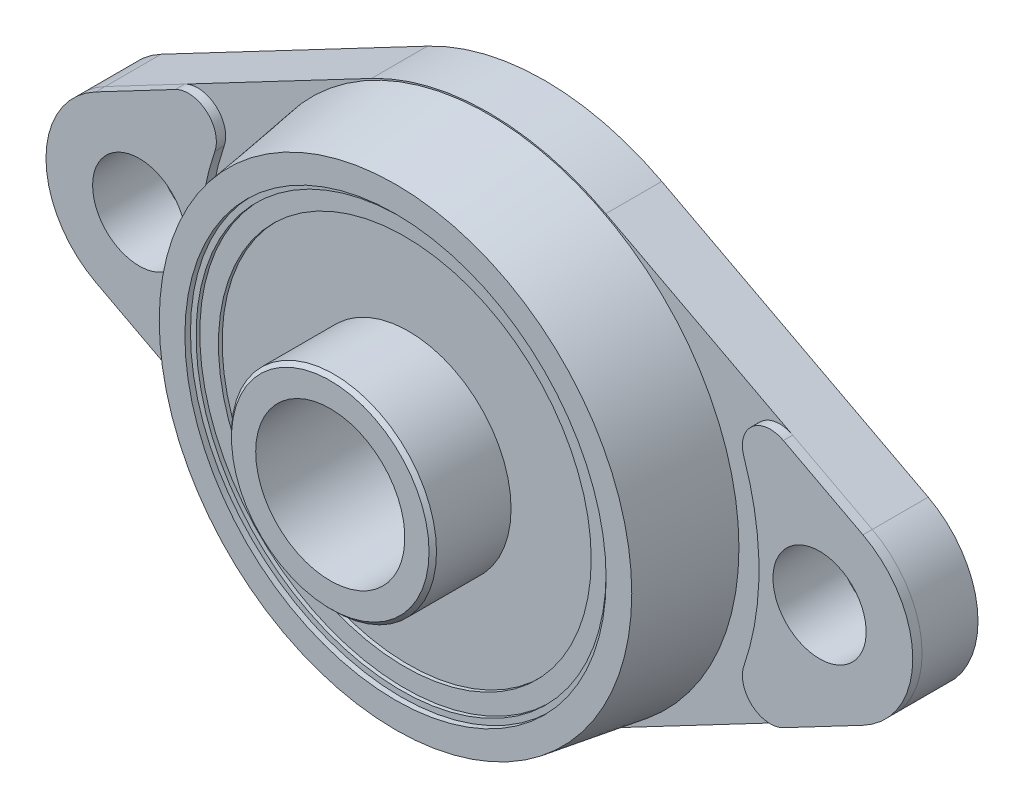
ISO-10303-21;
HEADER;
FILE_DESCRIPTION(('STEP AP214'),'2;1');
FILE_NAME('part.step','',(''),(''),'','','');
FILE_SCHEMA(('AUTOMOTIVE_DESIGN { 1 0 10303 214 1 1 1 1 }'));
ENDSEC;
DATA;
#1=APPLICATION_CONTEXT('core data for automotive mechanical design processes');
#2=APPLICATION_PROTOCOL_DEFINITION('international standard','automotive_design',2000,#1);
#3=PRODUCT_CONTEXT('',#1,'mechanical');
#4=PRODUCT('Part','Part','',(#3));
#5=PRODUCT_RELATED_PRODUCT_CATEGORY('part','',(#4));
#6=PRODUCT_DEFINITION_FORMATION('','',#4);
#7=PRODUCT_DEFINITION_CONTEXT('part definition',#1,'design');
#8=PRODUCT_DEFINITION('design','',#6,#7);
#9=PRODUCT_DEFINITION_SHAPE('','',#8);
#10=(LENGTH_UNIT() NAMED_UNIT(*) SI_UNIT(.MILLI.,.METRE.));
#11=(NAMED_UNIT(*) PLANE_ANGLE_UNIT() SI_UNIT($,.RADIAN.));
#12=(NAMED_UNIT(*) SI_UNIT($,.STERADIAN.) SOLID_ANGLE_UNIT());
#13=UNCERTAINTY_MEASURE_WITH_UNIT(LENGTH_MEASURE(1.E-05),#10,'distance_accuracy_value','');
#14=(GEOMETRIC_REPRESENTATION_CONTEXT(3) GLOBAL_UNCERTAINTY_ASSIGNED_CONTEXT((#13)) GLOBAL_UNIT_ASSIGNED_CONTEXT((#10,
#11,#12)) REPRESENTATION_CONTEXT('',''));
#15=CARTESIAN_POINT('',(0.,0.,0.));
#16=DIRECTION('',(0.,0.,1.));
#17=DIRECTION('',(1.,0.,0.));
#18=AXIS2_PLACEMENT_3D('',#15,#16,#17);
#19=CARTESIAN_POINT('',(-15.61047857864,5.344432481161,3.));
#20=DIRECTION('',(0.,0.,-1.));
#21=DIRECTION('',(1.,0.,0.));
#22=AXIS2_PLACEMENT_3D('',#19,#20,#21);
#23=CYLINDRICAL_SURFACE('',#22,1.5);
#24=CARTESIAN_POINT('',(-15.61047857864,5.344432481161,3.));
#25=DIRECTION('',(0.,0.,1.));
#26=DIRECTION('',(1.,0.,0.));
#27=AXIS2_PLACEMENT_3D('',#24,#25,#26);
#28=CIRCLE('',#27,1.5);
#29=CARTESIAN_POINT('',(-14.1913441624,4.858574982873,3.));
#30=VERTEX_POINT('',#29);
#31=CARTESIAN_POINT('',(-16.30910868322,6.671804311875,3.));
#32=VERTEX_POINT('',#31);
#33=EDGE_CURVE('E386',#30,#32,#28,.T.);
#34=ORIENTED_EDGE('',*,*,#33,.T.);
#35=DIRECTION('',(0.,0.,1.));
#36=VECTOR('',#35,1.);
#37=CARTESIAN_POINT('',(-16.30910868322,6.671804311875,3.));
#38=LINE('',#37,#36);
#39=CARTESIAN_POINT('',(-16.30910868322,6.671804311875,3.5));
#40=VERTEX_POINT('',#39);
#41=EDGE_CURVE('E353',#32,#40,#38,.T.);
#42=ORIENTED_EDGE('',*,*,#41,.T.);
#43=CARTESIAN_POINT('',(-15.61047857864,5.344432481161,3.5));
#44=DIRECTION('',(0.,0.,1.));
#45=DIRECTION('',(1.,0.,0.));
#46=AXIS2_PLACEMENT_3D('',#43,#44,#45);
#47=CIRCLE('',#46,1.5);
#48=CARTESIAN_POINT('',(-14.1913441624,4.858574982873,3.5));
#49=VERTEX_POINT('',#48);
#50=EDGE_CURVE('E397',#49,#40,#47,.T.);
#51=ORIENTED_EDGE('',*,*,#50,.F.);
#52=DIRECTION('',(0.,0.,1.));
#53=VECTOR('',#52,1.);
#54=CARTESIAN_POINT('',(-14.1913441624,4.858574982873,3.));
#55=LINE('',#54,#53);
#56=EDGE_CURVE('E9',#30,#49,#55,.T.);
#57=ORIENTED_EDGE('',*,*,#56,.F.);
#58=EDGE_LOOP('',(#34,#42,#51,#57));
#59=FACE_BOUND('',#58,.T.);
#60=ADVANCED_FACE('F15',(#59),#23,.T.);
#61=CARTESIAN_POINT('',(0.,0.,3.));
#62=DIRECTION('',(0.,0.,-1.));
#63=DIRECTION('',(1.,0.,0.));
#64=AXIS2_PLACEMENT_3D('',#61,#62,#63);
#65=CYLINDRICAL_SURFACE('',#64,15.);
#66=ORIENTED_EDGE('',*,*,#56,.T.);
#67=CARTESIAN_POINT('',(0.,0.,3.5));
#68=DIRECTION('',(0.,0.,1.));
#69=DIRECTION('',(1.,0.,0.));
#70=AXIS2_PLACEMENT_3D('',#67,#68,#69);
#71=CIRCLE('',#70,15.);
#72=CARTESIAN_POINT('',(-14.1913441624,-4.858574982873,3.5));
#73=VERTEX_POINT('',#72);
#74=EDGE_CURVE('E535',#49,#73,#71,.T.);
#75=ORIENTED_EDGE('',*,*,#74,.T.);
#76=DIRECTION('',(0.,0.,1.));
#77=VECTOR('',#76,1.);
#78=CARTESIAN_POINT('',(-14.1913441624,-4.858574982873,3.));
#79=LINE('',#78,#77);
#80=CARTESIAN_POINT('',(-14.1913441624,-4.858574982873,3.));
#81=VERTEX_POINT('',#80);
#82=EDGE_CURVE('E26',#81,#73,#79,.T.);
#83=ORIENTED_EDGE('',*,*,#82,.F.);
#84=CARTESIAN_POINT('',(0.,0.,3.));
#85=DIRECTION('',(0.,0.,1.));
#86=DIRECTION('',(1.,0.,0.));
#87=AXIS2_PLACEMENT_3D('',#84,#85,#86);
#88=CIRCLE('',#87,15.);
#89=EDGE_CURVE('E489',#30,#81,#88,.T.);
#90=ORIENTED_EDGE('',*,*,#89,.F.);
#91=EDGE_LOOP('',(#66,#75,#83,#90));
#92=FACE_BOUND('',#91,.T.);
#93=ADVANCED_FACE('F701',(#92),#65,.F.);
#94=CARTESIAN_POINT('',(-15.61047857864,-5.344432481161,3.));
#95=DIRECTION('',(0.,0.,-1.));
#96=DIRECTION('',(1.,0.,0.));
#97=AXIS2_PLACEMENT_3D('',#94,#95,#96);
#98=CYLINDRICAL_SURFACE('',#97,1.5);
#99=CARTESIAN_POINT('',(-15.61047857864,-5.344432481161,3.));
#100=DIRECTION('',(0.,0.,1.));
#101=DIRECTION('',(1.,0.,0.));
#102=AXIS2_PLACEMENT_3D('',#99,#100,#101);
#103=CIRCLE('',#102,1.5);
#104=CARTESIAN_POINT('',(-16.30910868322,-6.671804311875,3.));
#105=VERTEX_POINT('',#104);
#106=EDGE_CURVE('E493',#105,#81,#103,.T.);
#107=ORIENTED_EDGE('',*,*,#106,.T.);
#108=ORIENTED_EDGE('',*,*,#82,.T.);
#109=CARTESIAN_POINT('',(-15.61047857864,-5.344432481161,3.5));
#110=DIRECTION('',(0.,0.,1.));
#111=DIRECTION('',(1.,0.,0.));
#112=AXIS2_PLACEMENT_3D('',#109,#110,#111);
#113=CIRCLE('',#112,1.5);
#114=CARTESIAN_POINT('',(-16.30910868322,-6.671804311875,3.5));
#115=VERTEX_POINT('',#114);
#116=EDGE_CURVE('E199',#115,#73,#113,.T.);
#117=ORIENTED_EDGE('',*,*,#116,.F.);
#118=DIRECTION('',(0.,0.,1.));
#119=VECTOR('',#118,1.);
#120=CARTESIAN_POINT('',(-16.30910868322,-6.671804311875,3.));
#121=LINE('',#120,#119);
#122=EDGE_CURVE('E349',#105,#115,#121,.T.);
#123=ORIENTED_EDGE('',*,*,#122,.F.);
#124=EDGE_LOOP('',(#107,#108,#117,#123));
#125=FACE_BOUND('',#124,.T.);
#126=ADVANCED_FACE('F707',(#125),#98,.T.);
#127=CARTESIAN_POINT('',(15.610478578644,5.344432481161,3.));
#128=DIRECTION('',(0.,0.,-1.));
#129=DIRECTION('',(1.,0.,0.));
#130=AXIS2_PLACEMENT_3D('',#127,#128,#129);
#131=CYLINDRICAL_SURFACE('',#130,1.5);
#132=CARTESIAN_POINT('',(15.610478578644,5.344432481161,3.));
#133=DIRECTION('',(0.,0.,1.));
#134=DIRECTION('',(1.,0.,0.));
#135=AXIS2_PLACEMENT_3D('',#132,#133,#134);
#136=CIRCLE('',#135,1.5);
#137=CARTESIAN_POINT('',(16.309108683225,6.671804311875,3.));
#138=VERTEX_POINT('',#137);
#139=CARTESIAN_POINT('',(14.191344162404,4.858574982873,3.));
#140=VERTEX_POINT('',#139);
#141=EDGE_CURVE('E383',#138,#140,#136,.T.);
#142=ORIENTED_EDGE('',*,*,#141,.T.);
#143=DIRECTION('',(0.,0.,1.));
#144=VECTOR('',#143,1.);
#145=CARTESIAN_POINT('',(14.191344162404,4.858574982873,3.));
#146=LINE('',#145,#144);
#147=CARTESIAN_POINT('',(14.191344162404,4.858574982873,3.5));
#148=VERTEX_POINT('',#147);
#149=EDGE_CURVE('E40',#140,#148,#146,.T.);
#150=ORIENTED_EDGE('',*,*,#149,.T.);
#151=CARTESIAN_POINT('',(15.610478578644,5.344432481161,3.5));
#152=DIRECTION('',(0.,0.,1.));
#153=DIRECTION('',(1.,0.,0.));
#154=AXIS2_PLACEMENT_3D('',#151,#152,#153);
#155=CIRCLE('',#154,1.5);
#156=CARTESIAN_POINT('',(16.309108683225,6.671804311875,3.5));
#157=VERTEX_POINT('',#156);
#158=EDGE_CURVE('E340',#157,#148,#155,.T.);
#159=ORIENTED_EDGE('',*,*,#158,.F.);
#160=DIRECTION('',(0.,0.,1.));
#161=VECTOR('',#160,1.);
#162=CARTESIAN_POINT('',(16.309108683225,6.671804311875,3.));
#163=LINE('',#162,#161);
#164=EDGE_CURVE('E388',#138,#157,#163,.T.);
#165=ORIENTED_EDGE('',*,*,#164,.F.);
#166=EDGE_LOOP('',(#142,#150,#159,#165));
#167=FACE_BOUND('',#166,.T.);
#168=ADVANCED_FACE('F667',(#167),#131,.T.);
#169=CARTESIAN_POINT('',(0.,0.,3.));
#170=DIRECTION('',(0.,0.,-1.));
#171=DIRECTION('',(1.,0.,0.));
#172=AXIS2_PLACEMENT_3D('',#169,#170,#171);
#173=CYLINDRICAL_SURFACE('',#172,15.);
#174=DIRECTION('',(0.,0.,1.));
#175=VECTOR('',#174,1.);
#176=CARTESIAN_POINT('',(14.191344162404,-4.858574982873,3.));
#177=LINE('',#176,#175);
#178=CARTESIAN_POINT('',(14.191344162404,-4.858574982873,3.));
#179=VERTEX_POINT('',#178);
#180=CARTESIAN_POINT('',(14.191344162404,-4.858574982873,3.5));
#181=VERTEX_POINT('',#180);
#182=EDGE_CURVE('E342',#179,#181,#177,.T.);
#183=ORIENTED_EDGE('',*,*,#182,.T.);
#184=CARTESIAN_POINT('',(0.,0.,3.5));
#185=DIRECTION('',(0.,0.,1.));
#186=DIRECTION('',(1.,0.,0.));
#187=AXIS2_PLACEMENT_3D('',#184,#185,#186);
#188=CIRCLE('',#187,15.);
#189=EDGE_CURVE('E393',#181,#148,#188,.T.);
#190=ORIENTED_EDGE('',*,*,#189,.T.);
#191=ORIENTED_EDGE('',*,*,#149,.F.);
#192=CARTESIAN_POINT('',(0.,0.,3.));
#193=DIRECTION('',(0.,0.,1.));
#194=DIRECTION('',(1.,0.,0.));
#195=AXIS2_PLACEMENT_3D('',#192,#193,#194);
#196=CIRCLE('',#195,15.);
#197=EDGE_CURVE('E387',#179,#140,#196,.T.);
#198=ORIENTED_EDGE('',*,*,#197,.F.);
#199=EDGE_LOOP('',(#183,#190,#191,#198));
#200=FACE_BOUND('',#199,.T.);
#201=ADVANCED_FACE('F669',(#200),#173,.F.);
#202=CARTESIAN_POINT('',(15.610478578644,-5.344432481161,3.));
#203=DIRECTION('',(0.,0.,-1.));
#204=DIRECTION('',(1.,0.,0.));
#205=AXIS2_PLACEMENT_3D('',#202,#203,#204);
#206=CYLINDRICAL_SURFACE('',#205,1.5);
#207=CARTESIAN_POINT('',(15.610478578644,-5.344432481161,3.));
#208=DIRECTION('',(0.,0.,1.));
#209=DIRECTION('',(1.,0.,0.));
#210=AXIS2_PLACEMENT_3D('',#207,#208,#209);
#211=CIRCLE('',#210,1.5);
#212=CARTESIAN_POINT('',(16.309108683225,-6.671804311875,3.));
#213=VERTEX_POINT('',#212);
#214=EDGE_CURVE('E234',#179,#213,#211,.T.);
#215=ORIENTED_EDGE('',*,*,#214,.T.);
#216=DIRECTION('',(0.,0.,1.));
#217=VECTOR('',#216,1.);
#218=CARTESIAN_POINT('',(16.309108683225,-6.671804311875,3.));
#219=LINE('',#218,#217);
#220=CARTESIAN_POINT('',(16.309108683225,-6.671804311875,3.5));
#221=VERTEX_POINT('',#220);
#222=EDGE_CURVE('E376',#213,#221,#219,.T.);
#223=ORIENTED_EDGE('',*,*,#222,.T.);
#224=CARTESIAN_POINT('',(15.610478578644,-5.344432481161,3.5));
#225=DIRECTION('',(0.,0.,1.));
#226=DIRECTION('',(1.,0.,0.));
#227=AXIS2_PLACEMENT_3D('',#224,#225,#226);
#228=CIRCLE('',#227,1.5);
#229=EDGE_CURVE('E343',#181,#221,#228,.T.);
#230=ORIENTED_EDGE('',*,*,#229,.F.);
#231=ORIENTED_EDGE('',*,*,#182,.F.);
#232=EDGE_LOOP('',(#215,#223,#230,#231));
#233=FACE_BOUND('',#232,.T.);
#234=ADVANCED_FACE('F639',(#233),#206,.T.);
#235=CARTESIAN_POINT('',(0.,1.331029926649E-09,3.5));
#236=DIRECTION('',(0.,0.,1.));
#237=DIRECTION('',(1.,0.,0.));
#238=AXIS2_PLACEMENT_3D('',#235,#236,#237);
#239=PLANE('',#238);
#240=CARTESIAN_POINT('',(18.25,0.,3.5));
#241=DIRECTION('',(0.,0.,1.));
#242=DIRECTION('',(-1.,0.,0.));
#243=AXIS2_PLACEMENT_3D('',#240,#241,#242);
#244=CIRCLE('',#243,2.5);
#245=CARTESIAN_POINT('',(15.75,0.,3.5));
#246=VERTEX_POINT('',#245);
#247=EDGE_CURVE('E77',#246,#246,#244,.T.);
#248=ORIENTED_EDGE('',*,*,#247,.F.);
#249=EDGE_LOOP('',(#248));
#250=FACE_BOUND('',#249,.T.);
#251=ORIENTED_EDGE('',*,*,#189,.F.);
#252=ORIENTED_EDGE('',*,*,#229,.T.);
#253=DIRECTION('',(-0.884914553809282,-0.465753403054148,0.));
#254=VECTOR('',#253,1.);
#255=CARTESIAN_POINT('',(20.578766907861,-4.424572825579,3.5));
#256=LINE('',#255,#254);
#257=CARTESIAN_POINT('',(20.578766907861,-4.424572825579,3.5));
#258=VERTEX_POINT('',#257);
#259=EDGE_CURVE('E372',#258,#221,#256,.T.);
#260=ORIENTED_EDGE('',*,*,#259,.F.);
#261=CARTESIAN_POINT('',(18.25,0.,3.5));
#262=DIRECTION('',(0.,0.,-1.));
#263=DIRECTION('',(-1.,0.,0.));
#264=AXIS2_PLACEMENT_3D('',#261,#262,#263);
#265=CIRCLE('',#264,5.);
#266=CARTESIAN_POINT('',(20.578767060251,4.424572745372,3.5));
#267=VERTEX_POINT('',#266);
#268=EDGE_CURVE('E392',#267,#258,#265,.T.);
#269=ORIENTED_EDGE('',*,*,#268,.F.);
#270=DIRECTION('',(-0.884914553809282,0.465753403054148,0.));
#271=VECTOR('',#270,1.);
#272=CARTESIAN_POINT('',(20.578767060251,4.424572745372,3.5));
#273=LINE('',#272,#271);
#274=EDGE_CURVE('E382',#267,#157,#273,.T.);
#275=ORIENTED_EDGE('',*,*,#274,.T.);
#276=ORIENTED_EDGE('',*,*,#158,.T.);
#277=EDGE_LOOP('',(#251,#252,#260,#269,#275,#276));
#278=FACE_BOUND('',#277,.T.);
#279=ADVANCED_FACE('F637',(#250,#278),#239,.T.);
#280=CARTESIAN_POINT('',(0.,1.331029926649E-09,3.5));
#281=DIRECTION('',(0.,0.,1.));
#282=DIRECTION('',(1.,0.,0.));
#283=AXIS2_PLACEMENT_3D('',#280,#281,#282);
#284=PLANE('',#283);
#285=CARTESIAN_POINT('',(-18.25,0.,3.5));
#286=DIRECTION('',(0.,0.,1.));
#287=DIRECTION('',(-1.,0.,0.));
#288=AXIS2_PLACEMENT_3D('',#285,#286,#287);
#289=CIRCLE('',#288,2.5);
#290=CARTESIAN_POINT('',(-20.75,0.,3.5));
#291=VERTEX_POINT('',#290);
#292=EDGE_CURVE('E93',#291,#291,#289,.T.);
#293=ORIENTED_EDGE('',*,*,#292,.F.);
#294=EDGE_LOOP('',(#293));
#295=FACE_BOUND('',#294,.T.);
#296=CARTESIAN_POINT('',(-18.25,0.,3.5));
#297=DIRECTION('',(0.,0.,-1.));
#298=DIRECTION('',(-1.,0.,0.));
#299=AXIS2_PLACEMENT_3D('',#296,#297,#298);
#300=CIRCLE('',#299,5.);
#301=CARTESIAN_POINT('',(-20.57876690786,-4.424572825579,3.5));
#302=VERTEX_POINT('',#301);
#303=CARTESIAN_POINT('',(-20.57876706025,4.424572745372,3.5));
#304=VERTEX_POINT('',#303);
#305=EDGE_CURVE('E184',#302,#304,#300,.T.);
#306=ORIENTED_EDGE('',*,*,#305,.F.);
#307=DIRECTION('',(0.884914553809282,-0.465753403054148,0.));
#308=VECTOR('',#307,1.);
#309=CARTESIAN_POINT('',(-20.57876690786,-4.424572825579,3.5));
#310=LINE('',#309,#308);
#311=EDGE_CURVE('E345',#302,#115,#310,.T.);
#312=ORIENTED_EDGE('',*,*,#311,.T.);
#313=ORIENTED_EDGE('',*,*,#116,.T.);
#314=ORIENTED_EDGE('',*,*,#74,.F.);
#315=ORIENTED_EDGE('',*,*,#50,.T.);
#316=DIRECTION('',(0.884914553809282,0.465753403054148,0.));
#317=VECTOR('',#316,1.);
#318=CARTESIAN_POINT('',(-20.57876706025,4.424572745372,3.5));
#319=LINE('',#318,#317);
#320=EDGE_CURVE('E350',#304,#40,#319,.T.);
#321=ORIENTED_EDGE('',*,*,#320,.F.);
#322=EDGE_LOOP('',(#306,#312,#313,#314,#315,#321));
#323=FACE_BOUND('',#322,.T.);
#324=ADVANCED_FACE('F1031',(#295,#323),#284,.T.);
#325=CARTESIAN_POINT('',(-20.57876706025,4.424572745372,3.));
#326=DIRECTION('',(-0.465753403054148,0.884914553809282,0.));
#327=DIRECTION('',(0.,0.,1.));
#328=AXIS2_PLACEMENT_3D('',#325,#326,#327);
#329=PLANE('',#328);
#330=DIRECTION('',(0.,0.,1.));
#331=VECTOR('',#330,1.);
#332=CARTESIAN_POINT('',(-20.57876706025,4.424572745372,3.));
#333=LINE('',#332,#331);
#334=CARTESIAN_POINT('',(-20.57876706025,4.424572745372,3.));
#335=VERTEX_POINT('',#334);
#336=EDGE_CURVE('E354',#335,#304,#333,.T.);
#337=ORIENTED_EDGE('',*,*,#336,.T.);
#338=ORIENTED_EDGE('',*,*,#320,.T.);
#339=ORIENTED_EDGE('',*,*,#41,.F.);
#340=DIRECTION('',(0.884914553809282,0.465753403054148,0.));
#341=VECTOR('',#340,1.);
#342=CARTESIAN_POINT('',(-20.57876706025,4.424572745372,3.));
#343=LINE('',#342,#341);
#344=EDGE_CURVE('E488',#335,#32,#343,.T.);
#345=ORIENTED_EDGE('',*,*,#344,.F.);
#346=EDGE_LOOP('',(#337,#338,#339,#345));
#347=FACE_BOUND('',#346,.T.);
#348=ADVANCED_FACE('F711',(#347),#329,.T.);
#349=CARTESIAN_POINT('',(-18.25,0.,3.));
#350=DIRECTION('',(0.,0.,-1.));
#351=DIRECTION('',(-1.,0.,0.));
#352=AXIS2_PLACEMENT_3D('',#349,#350,#351);
#353=CYLINDRICAL_SURFACE('',#352,5.);
#354=DIRECTION('',(0.,0.,1.));
#355=VECTOR('',#354,1.);
#356=CARTESIAN_POINT('',(-20.57876690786,-4.424572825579,3.));
#357=LINE('',#356,#355);
#358=CARTESIAN_POINT('',(-20.57876690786,-4.424572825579,3.));
#359=VERTEX_POINT('',#358);
#360=EDGE_CURVE('E348',#359,#302,#357,.T.);
#361=ORIENTED_EDGE('',*,*,#360,.T.);
#362=ORIENTED_EDGE('',*,*,#305,.T.);
#363=ORIENTED_EDGE('',*,*,#336,.F.);
#364=CARTESIAN_POINT('',(-18.25,0.,3.));
#365=DIRECTION('',(0.,0.,-1.));
#366=DIRECTION('',(-1.,0.,0.));
#367=AXIS2_PLACEMENT_3D('',#364,#365,#366);
#368=CIRCLE('',#367,5.);
#369=EDGE_CURVE('E371',#359,#335,#368,.T.);
#370=ORIENTED_EDGE('',*,*,#369,.F.);
#371=EDGE_LOOP('',(#361,#362,#363,#370));
#372=FACE_BOUND('',#371,.T.);
#373=ADVANCED_FACE('F844',(#372),#353,.T.);
#374=CARTESIAN_POINT('',(-20.57876690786,-4.424572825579,3.));
#375=DIRECTION('',(0.465753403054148,0.884914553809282,0.));
#376=DIRECTION('',(0.,0.,-1.));
#377=AXIS2_PLACEMENT_3D('',#374,#375,#376);
#378=PLANE('',#377);
#379=DIRECTION('',(-0.884914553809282,0.465753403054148,0.));
#380=VECTOR('',#379,1.);
#381=CARTESIAN_POINT('',(-6.284783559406,-11.94786573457,3.));
#382=LINE('',#381,#380);
#383=EDGE_CURVE('E361',#105,#359,#382,.T.);
#384=ORIENTED_EDGE('',*,*,#383,.F.);
#385=ORIENTED_EDGE('',*,*,#122,.T.);
#386=ORIENTED_EDGE('',*,*,#311,.F.);
#387=ORIENTED_EDGE('',*,*,#360,.F.);
#388=EDGE_LOOP('',(#384,#385,#386,#387));
#389=FACE_BOUND('',#388,.T.);
#390=ADVANCED_FACE('F817',(#389),#378,.F.);
#391=CARTESIAN_POINT('',(20.578767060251,4.424572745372,3.));
#392=DIRECTION('',(-0.465753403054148,-0.884914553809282,0.));
#393=DIRECTION('',(-0.884914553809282,0.465753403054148,0.));
#394=AXIS2_PLACEMENT_3D('',#391,#392,#393);
#395=PLANE('',#394);
#396=DIRECTION('',(0.884914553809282,-0.465753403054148,0.));
#397=VECTOR('',#396,1.);
#398=CARTESIAN_POINT('',(6.2847835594,11.947865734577,3.));
#399=LINE('',#398,#397);
#400=CARTESIAN_POINT('',(20.578767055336,4.424572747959,3.));
#401=VERTEX_POINT('',#400);
#402=EDGE_CURVE('E542',#138,#401,#399,.T.);
#403=ORIENTED_EDGE('',*,*,#402,.F.);
#404=ORIENTED_EDGE('',*,*,#164,.T.);
#405=ORIENTED_EDGE('',*,*,#274,.F.);
#406=DIRECTION('',(0.,0.,1.));
#407=VECTOR('',#406,1.);
#408=CARTESIAN_POINT('',(20.578767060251,4.424572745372,3.));
#409=LINE('',#408,#407);
#410=EDGE_CURVE('E463',#401,#267,#409,.T.);
#411=ORIENTED_EDGE('',*,*,#410,.F.);
#412=EDGE_LOOP('',(#403,#404,#405,#411));
#413=FACE_BOUND('',#412,.T.);
#414=ADVANCED_FACE('F656',(#413),#395,.F.);
#415=CARTESIAN_POINT('',(18.25,0.,3.));
#416=DIRECTION('',(0.,0.,-1.));
#417=DIRECTION('',(-1.,0.,0.));
#418=AXIS2_PLACEMENT_3D('',#415,#416,#417);
#419=CYLINDRICAL_SURFACE('',#418,5.);
#420=ORIENTED_EDGE('',*,*,#410,.T.);
#421=ORIENTED_EDGE('',*,*,#268,.T.);
#422=DIRECTION('',(0.,0.,1.));
#423=VECTOR('',#422,1.);
#424=CARTESIAN_POINT('',(20.578766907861,-4.424572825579,3.));
#425=LINE('',#424,#423);
#426=CARTESIAN_POINT('',(20.578766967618,-4.424572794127,3.));
#427=VERTEX_POINT('',#426);
#428=EDGE_CURVE('E222',#427,#258,#425,.T.);
#429=ORIENTED_EDGE('',*,*,#428,.F.);
#430=CARTESIAN_POINT('',(18.25,0.,3.));
#431=DIRECTION('',(0.,0.,1.));
#432=DIRECTION('',(0.465753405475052,-0.884914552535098,0.));
#433=AXIS2_PLACEMENT_3D('',#430,#431,#432);
#434=CIRCLE('',#433,5.);
#435=EDGE_CURVE('E449',#427,#401,#434,.T.);
#436=ORIENTED_EDGE('',*,*,#435,.T.);
#437=EDGE_LOOP('',(#420,#421,#429,#436));
#438=FACE_BOUND('',#437,.T.);
#439=ADVANCED_FACE('F653',(#438),#419,.T.);
#440=CARTESIAN_POINT('',(1.361427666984E-09,3.364288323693E-10,3.));
#441=DIRECTION('',(0.,0.,1.));
#442=DIRECTION('',(1.,0.,0.));
#443=AXIS2_PLACEMENT_3D('',#440,#441,#442);
#444=PLANE('',#443);
#445=CARTESIAN_POINT('',(0.,0.,3.));
#446=DIRECTION('',(0.,0.,-1.));
#447=DIRECTION('',(1.,0.,0.));
#448=AXIS2_PLACEMENT_3D('',#445,#446,#447);
#449=CIRCLE('',#448,13.425);
#450=CARTESIAN_POINT('',(13.425,0.,3.));
#451=VERTEX_POINT('',#450);
#452=EDGE_CURVE('E408',#451,#451,#449,.T.);
#453=ORIENTED_EDGE('',*,*,#452,.T.);
#454=EDGE_LOOP('',(#453));
#455=FACE_BOUND('',#454,.T.);
#456=DIRECTION('',(-0.884914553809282,-0.465753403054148,0.));
#457=VECTOR('',#456,1.);
#458=CARTESIAN_POINT('',(20.578767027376,-4.424572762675,3.));
#459=LINE('',#458,#457);
#460=CARTESIAN_POINT('',(6.284783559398,-11.94786573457,3.));
#461=VERTEX_POINT('',#460);
#462=EDGE_CURVE('E502',#213,#461,#459,.T.);
#463=ORIENTED_EDGE('',*,*,#462,.F.);
#464=ORIENTED_EDGE('',*,*,#214,.F.);
#465=ORIENTED_EDGE('',*,*,#197,.T.);
#466=ORIENTED_EDGE('',*,*,#141,.F.);
#467=DIRECTION('',(0.884914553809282,-0.465753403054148,0.));
#468=VECTOR('',#467,1.);
#469=CARTESIAN_POINT('',(6.2847835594,11.947865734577,3.));
#470=LINE('',#469,#468);
#471=CARTESIAN_POINT('',(6.2847835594,11.947865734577,3.));
#472=VERTEX_POINT('',#471);
#473=EDGE_CURVE('E546',#472,#138,#470,.T.);
#474=ORIENTED_EDGE('',*,*,#473,.F.);
#475=CARTESIAN_POINT('',(0.,0.,3.));
#476=DIRECTION('',(0.,0.,-1.));
#477=DIRECTION('',(0.,1.,0.));
#478=AXIS2_PLACEMENT_3D('',#475,#476,#477);
#479=CIRCLE('',#478,13.5);
#480=CARTESIAN_POINT('',(-6.284783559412,11.947865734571,3.));
#481=VERTEX_POINT('',#480);
#482=EDGE_CURVE('E368',#481,#472,#479,.T.);
#483=ORIENTED_EDGE('',*,*,#482,.F.);
#484=DIRECTION('',(0.884914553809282,0.465753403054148,0.));
#485=VECTOR('',#484,1.);
#486=CARTESIAN_POINT('',(-20.57876706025,4.424572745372,3.));
#487=LINE('',#486,#485);
#488=EDGE_CURVE('E509',#32,#481,#487,.T.);
#489=ORIENTED_EDGE('',*,*,#488,.F.);
#490=ORIENTED_EDGE('',*,*,#33,.F.);
#491=ORIENTED_EDGE('',*,*,#89,.T.);
#492=ORIENTED_EDGE('',*,*,#106,.F.);
#493=DIRECTION('',(-0.884914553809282,0.465753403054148,0.));
#494=VECTOR('',#493,1.);
#495=CARTESIAN_POINT('',(-6.284783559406,-11.94786573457,3.));
#496=LINE('',#495,#494);
#497=CARTESIAN_POINT('',(-6.284783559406,-11.94786573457,3.));
#498=VERTEX_POINT('',#497);
#499=EDGE_CURVE('E539',#498,#105,#496,.T.);
#500=ORIENTED_EDGE('',*,*,#499,.F.);
#501=CARTESIAN_POINT('',(0.,0.,3.));
#502=DIRECTION('',(0.,0.,-1.));
#503=DIRECTION('',(0.,1.,0.));
#504=AXIS2_PLACEMENT_3D('',#501,#502,#503);
#505=CIRCLE('',#504,13.5);
#506=EDGE_CURVE('E339',#461,#498,#505,.T.);
#507=ORIENTED_EDGE('',*,*,#506,.F.);
#508=EDGE_LOOP('',(#463,#464,#465,#466,#474,#483,#489,#490,#491,#492,#500,#507));
#509=FACE_BOUND('',#508,.T.);
#510=ADVANCED_FACE('F664',(#455,#509),#444,.T.);
#511=CARTESIAN_POINT('',(20.578766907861,-4.424572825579,3.));
#512=DIRECTION('',(0.465753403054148,-0.884914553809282,0.));
#513=DIRECTION('',(0.,0.,-1.));
#514=AXIS2_PLACEMENT_3D('',#511,#512,#513);
#515=PLANE('',#514);
#516=ORIENTED_EDGE('',*,*,#428,.T.);
#517=ORIENTED_EDGE('',*,*,#259,.T.);
#518=ORIENTED_EDGE('',*,*,#222,.F.);
#519=DIRECTION('',(-0.884914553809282,-0.465753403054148,0.));
#520=VECTOR('',#519,1.);
#521=CARTESIAN_POINT('',(20.578767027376,-4.424572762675,3.));
#522=LINE('',#521,#520);
#523=EDGE_CURVE('E482',#427,#213,#522,.T.);
#524=ORIENTED_EDGE('',*,*,#523,.F.);
#525=EDGE_LOOP('',(#516,#517,#518,#524));
#526=FACE_BOUND('',#525,.T.);
#527=ADVANCED_FACE('F643',(#526),#515,.T.);
#528=CARTESIAN_POINT('',(0.,0.,8.));
#529=DIRECTION('',(0.,0.,-1.));
#530=DIRECTION('',(1.,0.,0.));
#531=AXIS2_PLACEMENT_3D('',#528,#529,#530);
#532=CONICAL_SURFACE('',#531,12.675000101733,0.148889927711);
#533=DIRECTION('',(0.148340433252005,0.,-0.988936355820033));
#534=VECTOR('',#533,1.);
#535=CARTESIAN_POINT('',(12.675000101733,0.,8.));
#536=LINE('',#535,#534);
#537=CARTESIAN_POINT('',(12.675000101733,0.,8.));
#538=VERTEX_POINT('',#537);
#539=EDGE_CURVE('E404',#538,#451,#536,.T.);
#540=ORIENTED_EDGE('',*,*,#539,.F.);
#541=CARTESIAN_POINT('',(0.,0.,8.));
#542=DIRECTION('',(0.,0.,-1.));
#543=DIRECTION('',(1.,0.,0.));
#544=AXIS2_PLACEMENT_3D('',#541,#542,#543);
#545=CIRCLE('',#544,12.675000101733);
#546=EDGE_CURVE('E483',#538,#538,#545,.T.);
#547=ORIENTED_EDGE('',*,*,#546,.T.);
#548=ORIENTED_EDGE('',*,*,#539,.T.);
#549=ORIENTED_EDGE('',*,*,#452,.F.);
#550=EDGE_LOOP('',(#540,#547,#548,#549));
#551=FACE_BOUND('',#550,.T.);
#552=ADVANCED_FACE('F806',(#551),#532,.T.);
#553=CARTESIAN_POINT('',(18.25,0.,0.));
#554=DIRECTION('',(0.,0.,1.));
#555=DIRECTION('',(-1.,0.,0.));
#556=AXIS2_PLACEMENT_3D('',#553,#554,#555);
#557=CYLINDRICAL_SURFACE('',#556,2.5);
#558=DIRECTION('',(0.,0.,1.));
#559=VECTOR('',#558,1.);
#560=CARTESIAN_POINT('',(15.75,0.,0.));
#561=LINE('',#560,#559);
#562=CARTESIAN_POINT('',(15.75,0.,0.));
#563=VERTEX_POINT('',#562);
#564=EDGE_CURVE('E157',#563,#246,#561,.T.);
#565=ORIENTED_EDGE('',*,*,#564,.F.);
#566=CARTESIAN_POINT('',(18.25,0.,0.));
#567=DIRECTION('',(0.,0.,-1.));
#568=DIRECTION('',(-1.,0.,0.));
#569=AXIS2_PLACEMENT_3D('',#566,#567,#568);
#570=CIRCLE('',#569,2.5);
#571=EDGE_CURVE('E497',#563,#563,#570,.T.);
#572=ORIENTED_EDGE('',*,*,#571,.T.);
#573=ORIENTED_EDGE('',*,*,#564,.T.);
#574=ORIENTED_EDGE('',*,*,#247,.T.);
#575=EDGE_LOOP('',(#565,#572,#573,#574));
#576=FACE_BOUND('',#575,.T.);
#577=ADVANCED_FACE('F800',(#576),#557,.F.);
#578=CARTESIAN_POINT('',(-18.25,0.,0.));
#579=DIRECTION('',(0.,0.,1.));
#580=DIRECTION('',(-1.,0.,0.));
#581=AXIS2_PLACEMENT_3D('',#578,#579,#580);
#582=CYLINDRICAL_SURFACE('',#581,2.5);
#583=DIRECTION('',(0.,0.,1.));
#584=VECTOR('',#583,1.);
#585=CARTESIAN_POINT('',(-20.75,0.,0.));
#586=LINE('',#585,#584);
#587=CARTESIAN_POINT('',(-20.75,0.,0.));
#588=VERTEX_POINT('',#587);
#589=EDGE_CURVE('E150',#588,#291,#586,.T.);
#590=ORIENTED_EDGE('',*,*,#589,.F.);
#591=CARTESIAN_POINT('',(-18.25,0.,0.));
#592=DIRECTION('',(0.,0.,-1.));
#593=DIRECTION('',(-1.,0.,0.));
#594=AXIS2_PLACEMENT_3D('',#591,#592,#593);
#595=CIRCLE('',#594,2.5);
#596=EDGE_CURVE('E569',#588,#588,#595,.T.);
#597=ORIENTED_EDGE('',*,*,#596,.T.);
#598=ORIENTED_EDGE('',*,*,#589,.T.);
#599=ORIENTED_EDGE('',*,*,#292,.T.);
#600=EDGE_LOOP('',(#590,#597,#598,#599));
#601=FACE_BOUND('',#600,.T.);
#602=ADVANCED_FACE('F805',(#601),#582,.F.);
#603=CARTESIAN_POINT('',(-20.57876706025,4.424572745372,0.));
#604=DIRECTION('',(-0.465753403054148,0.884914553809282,0.));
#605=DIRECTION('',(0.,0.,1.));
#606=AXIS2_PLACEMENT_3D('',#603,#604,#605);
#607=PLANE('',#606);
#608=DIRECTION('',(0.,0.,1.));
#609=VECTOR('',#608,1.);
#610=CARTESIAN_POINT('',(-20.57876706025,4.424572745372,0.));
#611=LINE('',#610,#609);
#612=CARTESIAN_POINT('',(-20.57876706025,4.424572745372,0.));
#613=VERTEX_POINT('',#612);
#614=EDGE_CURVE('E484',#613,#335,#611,.T.);
#615=ORIENTED_EDGE('',*,*,#614,.T.);
#616=ORIENTED_EDGE('',*,*,#344,.T.);
#617=ORIENTED_EDGE('',*,*,#488,.T.);
#618=DIRECTION('',(0.,0.,1.));
#619=VECTOR('',#618,1.);
#620=CARTESIAN_POINT('',(-6.284783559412,11.947865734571,0.));
#621=LINE('',#620,#619);
#622=CARTESIAN_POINT('',(-6.284783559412,11.947865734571,0.));
#623=VERTEX_POINT('',#622);
#624=EDGE_CURVE('E360',#623,#481,#621,.T.);
#625=ORIENTED_EDGE('',*,*,#624,.F.);
#626=DIRECTION('',(0.884914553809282,0.465753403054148,0.));
#627=VECTOR('',#626,1.);
#628=CARTESIAN_POINT('',(-20.57876706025,4.424572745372,0.));
#629=LINE('',#628,#627);
#630=EDGE_CURVE('E448',#613,#623,#629,.T.);
#631=ORIENTED_EDGE('',*,*,#630,.F.);
#632=EDGE_LOOP('',(#615,#616,#617,#625,#631));
#633=FACE_BOUND('',#632,.T.);
#634=ADVANCED_FACE('F686',(#633),#607,.T.);
#635=CARTESIAN_POINT('',(-18.25,0.,0.));
#636=DIRECTION('',(0.,0.,-1.));
#637=DIRECTION('',(-1.,0.,0.));
#638=AXIS2_PLACEMENT_3D('',#635,#636,#637);
#639=CYLINDRICAL_SURFACE('',#638,5.);
#640=DIRECTION('',(0.,0.,1.));
#641=VECTOR('',#640,1.);
#642=CARTESIAN_POINT('',(-20.57876690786,-4.424572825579,0.));
#643=LINE('',#642,#641);
#644=CARTESIAN_POINT('',(-20.57876690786,-4.424572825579,0.));
#645=VERTEX_POINT('',#644);
#646=EDGE_CURVE('E356',#645,#359,#643,.T.);
#647=ORIENTED_EDGE('',*,*,#646,.T.);
#648=ORIENTED_EDGE('',*,*,#369,.T.);
#649=ORIENTED_EDGE('',*,*,#614,.F.);
#650=CARTESIAN_POINT('',(-18.25,0.,0.));
#651=DIRECTION('',(0.,0.,-1.));
#652=DIRECTION('',(-1.,0.,0.));
#653=AXIS2_PLACEMENT_3D('',#650,#651,#652);
#654=CIRCLE('',#653,5.);
#655=EDGE_CURVE('E333',#645,#613,#654,.T.);
#656=ORIENTED_EDGE('',*,*,#655,.F.);
#657=EDGE_LOOP('',(#647,#648,#649,#656));
#658=FACE_BOUND('',#657,.T.);
#659=ADVANCED_FACE('F684',(#658),#639,.T.);
#660=CARTESIAN_POINT('',(0.,0.,0.));
#661=DIRECTION('',(0.,0.,-1.));
#662=DIRECTION('',(0.,1.,0.));
#663=AXIS2_PLACEMENT_3D('',#660,#661,#662);
#664=CYLINDRICAL_SURFACE('',#663,13.5);
#665=ORIENTED_EDGE('',*,*,#624,.T.);
#666=ORIENTED_EDGE('',*,*,#482,.T.);
#667=DIRECTION('',(0.,0.,1.));
#668=VECTOR('',#667,1.);
#669=CARTESIAN_POINT('',(6.2847835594,11.947865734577,0.));
#670=LINE('',#669,#668);
#671=CARTESIAN_POINT('',(6.2847835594,11.947865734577,0.));
#672=VERTEX_POINT('',#671);
#673=EDGE_CURVE('E338',#672,#472,#670,.T.);
#674=ORIENTED_EDGE('',*,*,#673,.F.);
#675=CARTESIAN_POINT('',(0.,0.,0.));
#676=DIRECTION('',(0.,0.,-1.));
#677=DIRECTION('',(0.,1.,0.));
#678=AXIS2_PLACEMENT_3D('',#675,#676,#677);
#679=CIRCLE('',#678,13.5);
#680=EDGE_CURVE('E444',#623,#672,#679,.T.);
#681=ORIENTED_EDGE('',*,*,#680,.F.);
#682=EDGE_LOOP('',(#665,#666,#674,#681));
#683=FACE_BOUND('',#682,.T.);
#684=ADVANCED_FACE('F689',(#683),#664,.T.);
#685=CARTESIAN_POINT('',(-6.284783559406,-11.94786573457,0.));
#686=DIRECTION('',(-0.465753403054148,-0.884914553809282,0.));
#687=DIRECTION('',(-0.884914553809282,0.465753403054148,0.));
#688=AXIS2_PLACEMENT_3D('',#685,#686,#687);
#689=PLANE('',#688);
#690=DIRECTION('',(0.,0.,1.));
#691=VECTOR('',#690,1.);
#692=CARTESIAN_POINT('',(-6.284783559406,-11.94786573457,0.));
#693=LINE('',#692,#691);
#694=CARTESIAN_POINT('',(-6.284783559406,-11.94786573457,0.));
#695=VERTEX_POINT('',#694);
#696=EDGE_CURVE('E335',#695,#498,#693,.T.);
#697=ORIENTED_EDGE('',*,*,#696,.T.);
#698=ORIENTED_EDGE('',*,*,#499,.T.);
#699=ORIENTED_EDGE('',*,*,#383,.T.);
#700=ORIENTED_EDGE('',*,*,#646,.F.);
#701=DIRECTION('',(-0.884914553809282,0.465753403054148,0.));
#702=VECTOR('',#701,1.);
#703=CARTESIAN_POINT('',(-6.284783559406,-11.94786573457,0.));
#704=LINE('',#703,#702);
#705=EDGE_CURVE('E526',#695,#645,#704,.T.);
#706=ORIENTED_EDGE('',*,*,#705,.F.);
#707=EDGE_LOOP('',(#697,#698,#699,#700,#706));
#708=FACE_BOUND('',#707,.T.);
#709=ADVANCED_FACE('F676',(#708),#689,.T.);
#710=CARTESIAN_POINT('',(6.2847835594,11.947865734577,0.));
#711=DIRECTION('',(0.465753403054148,0.884914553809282,0.));
#712=DIRECTION('',(0.,0.,-1.));
#713=AXIS2_PLACEMENT_3D('',#710,#711,#712);
#714=PLANE('',#713);
#715=ORIENTED_EDGE('',*,*,#673,.T.);
#716=ORIENTED_EDGE('',*,*,#473,.T.);
#717=ORIENTED_EDGE('',*,*,#402,.T.);
#718=DIRECTION('',(0.,0.,1.));
#719=VECTOR('',#718,1.);
#720=CARTESIAN_POINT('',(20.578767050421,4.424572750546,0.));
#721=LINE('',#720,#719);
#722=CARTESIAN_POINT('',(20.578767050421,4.424572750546,0.));
#723=VERTEX_POINT('',#722);
#724=EDGE_CURVE('E452',#723,#401,#721,.T.);
#725=ORIENTED_EDGE('',*,*,#724,.F.);
#726=DIRECTION('',(0.884914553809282,-0.465753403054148,0.));
#727=VECTOR('',#726,1.);
#728=CARTESIAN_POINT('',(6.2847835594,11.947865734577,0.));
#729=LINE('',#728,#727);
#730=EDGE_CURVE('E428',#672,#723,#729,.T.);
#731=ORIENTED_EDGE('',*,*,#730,.F.);
#732=EDGE_LOOP('',(#715,#716,#717,#725,#731));
#733=FACE_BOUND('',#732,.T.);
#734=ADVANCED_FACE('F658',(#733),#714,.T.);
#735=CARTESIAN_POINT('',(0.,0.,0.));
#736=DIRECTION('',(0.,0.,-1.));
#737=DIRECTION('',(0.,1.,0.));
#738=AXIS2_PLACEMENT_3D('',#735,#736,#737);
#739=CYLINDRICAL_SURFACE('',#738,13.5);
#740=DIRECTION('',(0.,0.,1.));
#741=VECTOR('',#740,1.);
#742=CARTESIAN_POINT('',(6.284783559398,-11.94786573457,0.));
#743=LINE('',#742,#741);
#744=CARTESIAN_POINT('',(6.284783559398,-11.94786573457,0.));
#745=VERTEX_POINT('',#744);
#746=EDGE_CURVE('E498',#745,#461,#743,.T.);
#747=ORIENTED_EDGE('',*,*,#746,.T.);
#748=ORIENTED_EDGE('',*,*,#506,.T.);
#749=ORIENTED_EDGE('',*,*,#696,.F.);
#750=CARTESIAN_POINT('',(0.,0.,0.));
#751=DIRECTION('',(0.,0.,-1.));
#752=DIRECTION('',(0.,1.,0.));
#753=AXIS2_PLACEMENT_3D('',#750,#751,#752);
#754=CIRCLE('',#753,13.5);
#755=EDGE_CURVE('E530',#745,#695,#754,.T.);
#756=ORIENTED_EDGE('',*,*,#755,.F.);
#757=EDGE_LOOP('',(#747,#748,#749,#756));
#758=FACE_BOUND('',#757,.T.);
#759=ADVANCED_FACE('F673',(#758),#739,.T.);
#760=CARTESIAN_POINT('',(18.25,0.,0.));
#761=DIRECTION('',(0.,0.,-1.));
#762=DIRECTION('',(0.465753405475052,-0.884914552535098,0.));
#763=AXIS2_PLACEMENT_3D('',#760,#761,#762);
#764=CYLINDRICAL_SURFACE('',#763,5.);
#765=CARTESIAN_POINT('',(18.25,0.,0.));
#766=DIRECTION('',(0.,0.,1.));
#767=DIRECTION('',(0.465753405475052,-0.884914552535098,0.));
#768=AXIS2_PLACEMENT_3D('',#765,#766,#767);
#769=CIRCLE('',#768,5.);
#770=CARTESIAN_POINT('',(20.578767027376,-4.424572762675,0.));
#771=VERTEX_POINT('',#770);
#772=EDGE_CURVE('E423',#771,#723,#769,.T.);
#773=ORIENTED_EDGE('',*,*,#772,.T.);
#774=ORIENTED_EDGE('',*,*,#724,.T.);
#775=ORIENTED_EDGE('',*,*,#435,.F.);
#776=DIRECTION('',(0.,0.,1.));
#777=VECTOR('',#776,1.);
#778=CARTESIAN_POINT('',(20.578767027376,-4.424572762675,0.));
#779=LINE('',#778,#777);
#780=EDGE_CURVE('E478',#771,#427,#779,.T.);
#781=ORIENTED_EDGE('',*,*,#780,.F.);
#782=EDGE_LOOP('',(#773,#774,#775,#781));
#783=FACE_BOUND('',#782,.T.);
#784=ADVANCED_FACE('F652',(#783),#764,.T.);
#785=CARTESIAN_POINT('',(20.578767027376,-4.424572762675,0.));
#786=DIRECTION('',(0.465753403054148,-0.884914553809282,0.));
#787=DIRECTION('',(0.,0.,-1.));
#788=AXIS2_PLACEMENT_3D('',#785,#786,#787);
#789=PLANE('',#788);
#790=ORIENTED_EDGE('',*,*,#780,.T.);
#791=ORIENTED_EDGE('',*,*,#523,.T.);
#792=ORIENTED_EDGE('',*,*,#462,.T.);
#793=ORIENTED_EDGE('',*,*,#746,.F.);
#794=DIRECTION('',(-0.884914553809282,-0.465753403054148,0.));
#795=VECTOR('',#794,1.);
#796=CARTESIAN_POINT('',(20.578767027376,-4.424572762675,0.));
#797=LINE('',#796,#795);
#798=EDGE_CURVE('E427',#771,#745,#797,.T.);
#799=ORIENTED_EDGE('',*,*,#798,.F.);
#800=EDGE_LOOP('',(#790,#791,#792,#793,#799));
#801=FACE_BOUND('',#800,.T.);
#802=ADVANCED_FACE('F649',(#801),#789,.T.);
#803=CARTESIAN_POINT('',(0.,0.,8.));
#804=DIRECTION('',(0.,0.,-1.));
#805=DIRECTION('',(0.,-1.,0.));
#806=AXIS2_PLACEMENT_3D('',#803,#804,#805);
#807=PLANE('',#806);
#808=CARTESIAN_POINT('',(0.,0.,8.));
#809=DIRECTION('',(0.,0.,-1.));
#810=DIRECTION('',(1.,0.,0.));
#811=AXIS2_PLACEMENT_3D('',#808,#809,#810);
#812=CIRCLE('',#811,11.3);
#813=CARTESIAN_POINT('',(11.3,0.,8.));
#814=VERTEX_POINT('',#813);
#815=EDGE_CURVE('E303',#814,#814,#812,.T.);
#816=ORIENTED_EDGE('',*,*,#815,.T.);
#817=EDGE_LOOP('',(#816));
#818=FACE_BOUND('',#817,.T.);
#819=ORIENTED_EDGE('',*,*,#546,.F.);
#820=EDGE_LOOP('',(#819));
#821=FACE_BOUND('',#820,.T.);
#822=ADVANCED_FACE('F793',(#818,#821),#807,.F.);
#823=CARTESIAN_POINT('',(1.361427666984E-09,3.364288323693E-10,0.));
#824=DIRECTION('',(0.,0.,1.));
#825=DIRECTION('',(1.,0.,0.));
#826=AXIS2_PLACEMENT_3D('',#823,#824,#825);
#827=PLANE('',#826);
#828=ORIENTED_EDGE('',*,*,#571,.F.);
#829=EDGE_LOOP('',(#828));
#830=FACE_BOUND('',#829,.T.);
#831=CARTESIAN_POINT('',(0.,0.,0.));
#832=DIRECTION('',(0.,0.,1.));
#833=DIRECTION('',(1.,0.,0.));
#834=AXIS2_PLACEMENT_3D('',#831,#832,#833);
#835=CIRCLE('',#834,11.);
#836=CARTESIAN_POINT('',(11.,0.,0.));
#837=VERTEX_POINT('',#836);
#838=EDGE_CURVE('E313',#837,#837,#835,.T.);
#839=ORIENTED_EDGE('',*,*,#838,.T.);
#840=EDGE_LOOP('',(#839));
#841=FACE_BOUND('',#840,.T.);
#842=ORIENTED_EDGE('',*,*,#596,.F.);
#843=EDGE_LOOP('',(#842));
#844=FACE_BOUND('',#843,.T.);
#845=ORIENTED_EDGE('',*,*,#755,.T.);
#846=ORIENTED_EDGE('',*,*,#705,.T.);
#847=ORIENTED_EDGE('',*,*,#655,.T.);
#848=ORIENTED_EDGE('',*,*,#630,.T.);
#849=ORIENTED_EDGE('',*,*,#680,.T.);
#850=ORIENTED_EDGE('',*,*,#730,.T.);
#851=ORIENTED_EDGE('',*,*,#772,.F.);
#852=ORIENTED_EDGE('',*,*,#798,.T.);
#853=EDGE_LOOP('',(#845,#846,#847,#848,#849,#850,#851,#852));
#854=FACE_BOUND('',#853,.T.);
#855=ADVANCED_FACE('F320',(#830,#841,#844,#854),#827,.F.);
#856=CARTESIAN_POINT('',(0.,0.,8.));
#857=DIRECTION('',(0.,0.,-1.));
#858=DIRECTION('',(1.,0.,0.));
#859=AXIS2_PLACEMENT_3D('',#856,#857,#858);
#860=CYLINDRICAL_SURFACE('',#859,11.3);
#861=DIRECTION('',(0.,0.,-1.));
#862=VECTOR('',#861,1.);
#863=CARTESIAN_POINT('',(11.3,0.,8.));
#864=LINE('',#863,#862);
#865=CARTESIAN_POINT('',(11.3,0.,7.7));
#866=VERTEX_POINT('',#865);
#867=EDGE_CURVE('E317',#814,#866,#864,.T.);
#868=ORIENTED_EDGE('',*,*,#867,.T.);
#869=CARTESIAN_POINT('',(0.,0.,7.7));
#870=DIRECTION('',(0.,0.,-1.));
#871=DIRECTION('',(1.,0.,0.));
#872=AXIS2_PLACEMENT_3D('',#869,#870,#871);
#873=CIRCLE('',#872,11.3);
#874=EDGE_CURVE('E323',#866,#866,#873,.T.);
#875=ORIENTED_EDGE('',*,*,#874,.T.);
#876=ORIENTED_EDGE('',*,*,#867,.F.);
#877=ORIENTED_EDGE('',*,*,#815,.F.);
#878=EDGE_LOOP('',(#868,#875,#876,#877));
#879=FACE_BOUND('',#878,.T.);
#880=ADVANCED_FACE('F783',(#879),#860,.F.);
#881=CARTESIAN_POINT('',(0.,0.,0.));
#882=DIRECTION('',(0.,0.,-1.));
#883=DIRECTION('',(1.,0.,0.));
#884=AXIS2_PLACEMENT_3D('',#881,#882,#883);
#885=CYLINDRICAL_SURFACE('',#884,11.);
#886=ORIENTED_EDGE('',*,*,#838,.F.);
#887=DIRECTION('',(0.,0.,1.));
#888=VECTOR('',#887,1.);
#889=CARTESIAN_POINT('',(11.,0.,0.));
#890=LINE('',#889,#888);
#891=CARTESIAN_POINT('',(11.,0.,0.5));
#892=VERTEX_POINT('',#891);
#893=EDGE_CURVE('E310',#837,#892,#890,.T.);
#894=ORIENTED_EDGE('',*,*,#893,.T.);
#895=CARTESIAN_POINT('',(0.,0.,0.5));
#896=DIRECTION('',(0.,0.,-1.));
#897=DIRECTION('',(1.,0.,0.));
#898=AXIS2_PLACEMENT_3D('',#895,#896,#897);
#899=CIRCLE('',#898,11.);
#900=EDGE_CURVE('E315',#892,#892,#899,.T.);
#901=ORIENTED_EDGE('',*,*,#900,.F.);
#902=ORIENTED_EDGE('',*,*,#893,.F.);
#903=EDGE_LOOP('',(#886,#894,#901,#902));
#904=FACE_BOUND('',#903,.T.);
#905=ADVANCED_FACE('F312',(#904),#885,.F.);
#906=CARTESIAN_POINT('',(0.,0.,7.7));
#907=DIRECTION('',(0.,0.,-1.));
#908=DIRECTION('',(0.,-1.,0.));
#909=AXIS2_PLACEMENT_3D('',#906,#907,#908);
#910=PLANE('',#909);
#911=CARTESIAN_POINT('',(0.,0.,7.7));
#912=DIRECTION('',(0.,0.,-1.));
#913=DIRECTION('',(1.,0.,0.));
#914=AXIS2_PLACEMENT_3D('',#911,#912,#913);
#915=CIRCLE('',#914,11.);
#916=CARTESIAN_POINT('',(11.,0.,7.7));
#917=VERTEX_POINT('',#916);
#918=EDGE_CURVE('E440',#917,#917,#915,.T.);
#919=ORIENTED_EDGE('',*,*,#918,.T.);
#920=EDGE_LOOP('',(#919));
#921=FACE_BOUND('',#920,.T.);
#922=ORIENTED_EDGE('',*,*,#874,.F.);
#923=EDGE_LOOP('',(#922));
#924=FACE_BOUND('',#923,.T.);
#925=ADVANCED_FACE('F768',(#921,#924),#910,.F.);
#926=CARTESIAN_POINT('',(0.,0.,0.5));
#927=DIRECTION('',(0.,0.,1.));
#928=DIRECTION('',(1.,0.,0.));
#929=AXIS2_PLACEMENT_3D('',#926,#927,#928);
#930=PLANE('',#929);
#931=CARTESIAN_POINT('',(0.,0.,0.5));
#932=DIRECTION('',(0.,0.,-1.));
#933=DIRECTION('',(1.,0.,0.));
#934=AXIS2_PLACEMENT_3D('',#931,#932,#933);
#935=CIRCLE('',#934,10.);
#936=CARTESIAN_POINT('',(10.,0.,0.5));
#937=VERTEX_POINT('',#936);
#938=EDGE_CURVE('E555',#937,#937,#935,.T.);
#939=ORIENTED_EDGE('',*,*,#938,.F.);
#940=EDGE_LOOP('',(#939));
#941=FACE_BOUND('',#940,.T.);
#942=ORIENTED_EDGE('',*,*,#900,.T.);
#943=EDGE_LOOP('',(#942));
#944=FACE_BOUND('',#943,.T.);
#945=ADVANCED_FACE('F17',(#941,#944),#930,.F.);
#946=CARTESIAN_POINT('',(0.,0.,7.7));
#947=DIRECTION('',(0.,0.,-1.));
#948=DIRECTION('',(1.,0.,0.));
#949=AXIS2_PLACEMENT_3D('',#946,#947,#948);
#950=CYLINDRICAL_SURFACE('',#949,11.);
#951=DIRECTION('',(0.,0.,-1.));
#952=VECTOR('',#951,1.);
#953=CARTESIAN_POINT('',(11.,0.,7.7));
#954=LINE('',#953,#952);
#955=CARTESIAN_POINT('',(11.,0.,7.5));
#956=VERTEX_POINT('',#955);
#957=EDGE_CURVE('E443',#917,#956,#954,.T.);
#958=ORIENTED_EDGE('',*,*,#957,.T.);
#959=CARTESIAN_POINT('',(0.,0.,7.5));
#960=DIRECTION('',(0.,0.,-1.));
#961=DIRECTION('',(1.,0.,0.));
#962=AXIS2_PLACEMENT_3D('',#959,#960,#961);
#963=CIRCLE('',#962,11.);
#964=EDGE_CURVE('E473',#956,#956,#963,.T.);
#965=ORIENTED_EDGE('',*,*,#964,.T.);
#966=ORIENTED_EDGE('',*,*,#957,.F.);
#967=ORIENTED_EDGE('',*,*,#918,.F.);
#968=EDGE_LOOP('',(#958,#965,#966,#967));
#969=FACE_BOUND('',#968,.T.);
#970=ADVANCED_FACE('F742',(#969),#950,.F.);
#971=CARTESIAN_POINT('',(0.,0.,0.5));
#972=DIRECTION('',(0.,0.,-1.));
#973=DIRECTION('',(1.,0.,0.));
#974=AXIS2_PLACEMENT_3D('',#971,#972,#973);
#975=CYLINDRICAL_SURFACE('',#974,10.);
#976=ORIENTED_EDGE('',*,*,#938,.T.);
#977=DIRECTION('',(0.,0.,1.));
#978=VECTOR('',#977,1.);
#979=CARTESIAN_POINT('',(10.,0.,0.5));
#980=LINE('',#979,#978);
#981=CARTESIAN_POINT('',(10.,0.,0.7));
#982=VERTEX_POINT('',#981);
#983=EDGE_CURVE('E559',#937,#982,#980,.T.);
#984=ORIENTED_EDGE('',*,*,#983,.T.);
#985=CARTESIAN_POINT('',(0.,0.,0.7));
#986=DIRECTION('',(0.,0.,-1.));
#987=DIRECTION('',(1.,0.,0.));
#988=AXIS2_PLACEMENT_3D('',#985,#986,#987);
#989=CIRCLE('',#988,10.);
#990=EDGE_CURVE('E469',#982,#982,#989,.T.);
#991=ORIENTED_EDGE('',*,*,#990,.F.);
#992=ORIENTED_EDGE('',*,*,#983,.F.);
#993=EDGE_LOOP('',(#976,#984,#991,#992));
#994=FACE_BOUND('',#993,.T.);
#995=ADVANCED_FACE('F737',(#994),#975,.F.);
#996=CARTESIAN_POINT('',(0.,0.,7.5));
#997=DIRECTION('',(0.,0.,1.));
#998=DIRECTION('',(1.,0.,0.));
#999=AXIS2_PLACEMENT_3D('',#996,#997,#998);
#1000=PLANE('',#999);
#1001=CARTESIAN_POINT('',(0.,0.,7.5));
#1002=DIRECTION('',(0.,0.,1.));
#1003=DIRECTION('',(1.,0.,0.));
#1004=AXIS2_PLACEMENT_3D('',#1001,#1002,#1003);
#1005=CIRCLE('',#1004,10.);
#1006=CARTESIAN_POINT('',(10.,0.,7.5));
#1007=VERTEX_POINT('',#1006);
#1008=EDGE_CURVE('E362',#1007,#1007,#1005,.T.);
#1009=ORIENTED_EDGE('',*,*,#1008,.F.);
#1010=EDGE_LOOP('',(#1009));
#1011=FACE_BOUND('',#1010,.T.);
#1012=ORIENTED_EDGE('',*,*,#964,.F.);
#1013=EDGE_LOOP('',(#1012));
#1014=FACE_BOUND('',#1013,.T.);
#1015=ADVANCED_FACE('F733',(#1011,#1014),#1000,.T.);
#1016=CARTESIAN_POINT('',(0.,0.,0.7));
#1017=DIRECTION('',(0.,0.,1.));
#1018=DIRECTION('',(1.,0.,0.));
#1019=AXIS2_PLACEMENT_3D('',#1016,#1017,#1018);
#1020=PLANE('',#1019);
#1021=CARTESIAN_POINT('',(0.,0.,0.7));
#1022=DIRECTION('',(0.,0.,-1.));
#1023=DIRECTION('',(1.,0.,0.));
#1024=AXIS2_PLACEMENT_3D('',#1021,#1022,#1023);
#1025=CIRCLE('',#1024,5.5);
#1026=CARTESIAN_POINT('',(5.5,0.,0.7));
#1027=VERTEX_POINT('',#1026);
#1028=EDGE_CURVE('E367',#1027,#1027,#1025,.T.);
#1029=ORIENTED_EDGE('',*,*,#1028,.F.);
#1030=EDGE_LOOP('',(#1029));
#1031=FACE_BOUND('',#1030,.T.);
#1032=ORIENTED_EDGE('',*,*,#990,.T.);
#1033=EDGE_LOOP('',(#1032));
#1034=FACE_BOUND('',#1033,.T.);
#1035=ADVANCED_FACE('F736',(#1031,#1034),#1020,.F.);
#1036=CARTESIAN_POINT('',(0.,0.,7.5));
#1037=DIRECTION('',(0.,0.,1.));
#1038=DIRECTION('',(1.,0.,0.));
#1039=AXIS2_PLACEMENT_3D('',#1036,#1037,#1038);
#1040=CYLINDRICAL_SURFACE('',#1039,10.);
#1041=ORIENTED_EDGE('',*,*,#1008,.T.);
#1042=DIRECTION('',(0.,0.,-1.));
#1043=VECTOR('',#1042,1.);
#1044=CARTESIAN_POINT('',(10.,0.,7.5));
#1045=LINE('',#1044,#1043);
#1046=CARTESIAN_POINT('',(10.,0.,7.3));
#1047=VERTEX_POINT('',#1046);
#1048=EDGE_CURVE('E366',#1007,#1047,#1045,.T.);
#1049=ORIENTED_EDGE('',*,*,#1048,.T.);
#1050=CARTESIAN_POINT('',(0.,0.,7.3));
#1051=DIRECTION('',(0.,0.,1.));
#1052=DIRECTION('',(1.,0.,0.));
#1053=AXIS2_PLACEMENT_3D('',#1050,#1051,#1052);
#1054=CIRCLE('',#1053,10.);
#1055=EDGE_CURVE('E418',#1047,#1047,#1054,.T.);
#1056=ORIENTED_EDGE('',*,*,#1055,.F.);
#1057=ORIENTED_EDGE('',*,*,#1048,.F.);
#1058=EDGE_LOOP('',(#1041,#1049,#1056,#1057));
#1059=FACE_BOUND('',#1058,.T.);
#1060=ADVANCED_FACE('F724',(#1059),#1040,.F.);
#1061=CARTESIAN_POINT('',(0.,0.,0.5));
#1062=DIRECTION('',(0.,0.,-1.));
#1063=DIRECTION('',(1.,0.,0.));
#1064=AXIS2_PLACEMENT_3D('',#1061,#1062,#1063);
#1065=CYLINDRICAL_SURFACE('',#1064,5.5);
#1066=CARTESIAN_POINT('',(0.,0.,0.5));
#1067=DIRECTION('',(0.,0.,-1.));
#1068=DIRECTION('',(1.,0.,0.));
#1069=AXIS2_PLACEMENT_3D('',#1066,#1067,#1068);
#1070=CIRCLE('',#1069,5.5);
#1071=CARTESIAN_POINT('',(5.5,0.,0.5));
#1072=VERTEX_POINT('',#1071);
#1073=EDGE_CURVE('E422',#1072,#1072,#1070,.T.);
#1074=ORIENTED_EDGE('',*,*,#1073,.F.);
#1075=DIRECTION('',(0.,0.,1.));
#1076=VECTOR('',#1075,1.);
#1077=CARTESIAN_POINT('',(5.5,0.,0.5));
#1078=LINE('',#1077,#1076);
#1079=EDGE_CURVE('E19',#1072,#1027,#1078,.T.);
#1080=ORIENTED_EDGE('',*,*,#1079,.T.);
#1081=ORIENTED_EDGE('',*,*,#1028,.T.);
#1082=ORIENTED_EDGE('',*,*,#1079,.F.);
#1083=EDGE_LOOP('',(#1074,#1080,#1081,#1082));
#1084=FACE_BOUND('',#1083,.T.);
#1085=ADVANCED_FACE('F715',(#1084),#1065,.T.);
#1086=CARTESIAN_POINT('',(0.,0.,7.3));
#1087=DIRECTION('',(0.,0.,1.));
#1088=DIRECTION('',(1.,0.,0.));
#1089=AXIS2_PLACEMENT_3D('',#1086,#1087,#1088);
#1090=PLANE('',#1089);
#1091=CARTESIAN_POINT('',(0.,0.,7.3));
#1092=DIRECTION('',(0.,0.,-1.));
#1093=DIRECTION('',(1.,0.,0.));
#1094=AXIS2_PLACEMENT_3D('',#1091,#1092,#1093);
#1095=CIRCLE('',#1094,5.5);
#1096=CARTESIAN_POINT('',(5.5,0.,7.3));
#1097=VERTEX_POINT('',#1096);
#1098=EDGE_CURVE('E438',#1097,#1097,#1095,.T.);
#1099=ORIENTED_EDGE('',*,*,#1098,.T.);
#1100=EDGE_LOOP('',(#1099));
#1101=FACE_BOUND('',#1100,.T.);
#1102=ORIENTED_EDGE('',*,*,#1055,.T.);
#1103=EDGE_LOOP('',(#1102));
#1104=FACE_BOUND('',#1103,.T.);
#1105=ADVANCED_FACE('F712',(#1101,#1104),#1090,.T.);
#1106=CARTESIAN_POINT('',(0.,0.,0.5));
#1107=DIRECTION('',(0.,0.,1.));
#1108=DIRECTION('',(1.,0.,0.));
#1109=AXIS2_PLACEMENT_3D('',#1106,#1107,#1108);
#1110=PLANE('',#1109);
#1111=CARTESIAN_POINT('',(0.,0.,0.5));
#1112=DIRECTION('',(0.,0.,-1.));
#1113=DIRECTION('',(-1.,0.,0.));
#1114=AXIS2_PLACEMENT_3D('',#1111,#1112,#1113);
#1115=CIRCLE('',#1114,4.);
#1116=CARTESIAN_POINT('',(-4.,0.,0.5));
#1117=VERTEX_POINT('',#1116);
#1118=EDGE_CURVE('E439',#1117,#1117,#1115,.T.);
#1119=ORIENTED_EDGE('',*,*,#1118,.F.);
#1120=EDGE_LOOP('',(#1119));
#1121=FACE_BOUND('',#1120,.T.);
#1122=ORIENTED_EDGE('',*,*,#1073,.T.);
#1123=EDGE_LOOP('',(#1122));
#1124=FACE_BOUND('',#1123,.T.);
#1125=ADVANCED_FACE('F714',(#1121,#1124),#1110,.F.);
#1126=CARTESIAN_POINT('',(0.,0.,0.5));
#1127=DIRECTION('',(0.,0.,-1.));
#1128=DIRECTION('',(1.,0.,0.));
#1129=AXIS2_PLACEMENT_3D('',#1126,#1127,#1128);
#1130=CYLINDRICAL_SURFACE('',#1129,5.5);
#1131=DIRECTION('',(0.,0.,1.));
#1132=VECTOR('',#1131,1.);
#1133=CARTESIAN_POINT('',(5.5,0.,0.5));
#1134=LINE('',#1133,#1132);
#1135=CARTESIAN_POINT('',(5.5,0.,11.3));
#1136=VERTEX_POINT('',#1135);
#1137=EDGE_CURVE('E434',#1097,#1136,#1134,.T.);
#1138=ORIENTED_EDGE('',*,*,#1137,.F.);
#1139=ORIENTED_EDGE('',*,*,#1098,.F.);
#1140=ORIENTED_EDGE('',*,*,#1137,.T.);
#1141=CARTESIAN_POINT('',(0.,0.,11.3));
#1142=DIRECTION('',(0.,0.,-1.));
#1143=DIRECTION('',(1.,0.,0.));
#1144=AXIS2_PLACEMENT_3D('',#1141,#1142,#1143);
#1145=CIRCLE('',#1144,5.5);
#1146=EDGE_CURVE('E413',#1136,#1136,#1145,.T.);
#1147=ORIENTED_EDGE('',*,*,#1146,.T.);
#1148=EDGE_LOOP('',(#1138,#1139,#1140,#1147));
#1149=FACE_BOUND('',#1148,.T.);
#1150=ADVANCED_FACE('F721',(#1149),#1130,.T.);
#1151=CARTESIAN_POINT('',(0.,0.,0.5));
#1152=DIRECTION('',(0.,0.,1.));
#1153=DIRECTION('',(-1.,0.,0.));
#1154=AXIS2_PLACEMENT_3D('',#1151,#1152,#1153);
#1155=CYLINDRICAL_SURFACE('',#1154,4.);
#1156=DIRECTION('',(0.,0.,1.));
#1157=VECTOR('',#1156,1.);
#1158=CARTESIAN_POINT('',(-4.,0.,0.5));
#1159=LINE('',#1158,#1157);
#1160=CARTESIAN_POINT('',(-4.,0.,11.5));
#1161=VERTEX_POINT('',#1160);
#1162=EDGE_CURVE('E417',#1117,#1161,#1159,.T.);
#1163=ORIENTED_EDGE('',*,*,#1162,.F.);
#1164=ORIENTED_EDGE('',*,*,#1118,.T.);
#1165=ORIENTED_EDGE('',*,*,#1162,.T.);
#1166=CARTESIAN_POINT('',(0.,0.,11.5));
#1167=DIRECTION('',(0.,0.,1.));
#1168=DIRECTION('',(-1.,0.,0.));
#1169=AXIS2_PLACEMENT_3D('',#1166,#1167,#1168);
#1170=CIRCLE('',#1169,4.);
#1171=EDGE_CURVE('E398',#1161,#1161,#1170,.T.);
#1172=ORIENTED_EDGE('',*,*,#1171,.T.);
#1173=EDGE_LOOP('',(#1163,#1164,#1165,#1172));
#1174=FACE_BOUND('',#1173,.T.);
#1175=ADVANCED_FACE('F851',(#1174),#1155,.F.);
#1176=CARTESIAN_POINT('',(0.,0.,11.3));
#1177=DIRECTION('',(0.,0.,-1.));
#1178=DIRECTION('',(1.,0.,0.));
#1179=AXIS2_PLACEMENT_3D('',#1176,#1177,#1178);
#1180=CONICAL_SURFACE('',#1179,5.5,0.785398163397);
#1181=DIRECTION('',(0.707106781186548,0.,-0.707106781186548));
#1182=VECTOR('',#1181,1.);
#1183=CARTESIAN_POINT('',(5.5,0.,11.3));
#1184=LINE('',#1183,#1182);
#1185=CARTESIAN_POINT('',(5.3,0.,11.5));
#1186=VERTEX_POINT('',#1185);
#1187=EDGE_CURVE('E402',#1186,#1136,#1184,.T.);
#1188=ORIENTED_EDGE('',*,*,#1187,.F.);
#1189=CARTESIAN_POINT('',(0.,0.,11.5));
#1190=DIRECTION('',(0.,0.,-1.));
#1191=DIRECTION('',(1.,0.,0.));
#1192=AXIS2_PLACEMENT_3D('',#1189,#1190,#1191);
#1193=CIRCLE('',#1192,5.3);
#1194=EDGE_CURVE('E403',#1186,#1186,#1193,.T.);
#1195=ORIENTED_EDGE('',*,*,#1194,.T.);
#1196=ORIENTED_EDGE('',*,*,#1187,.T.);
#1197=ORIENTED_EDGE('',*,*,#1146,.F.);
#1198=EDGE_LOOP('',(#1188,#1195,#1196,#1197));
#1199=FACE_BOUND('',#1198,.T.);
#1200=ADVANCED_FACE('F760',(#1199),#1180,.T.);
#1201=CARTESIAN_POINT('',(0.,0.,11.5));
#1202=DIRECTION('',(0.,0.,1.));
#1203=DIRECTION('',(1.,0.,0.));
#1204=AXIS2_PLACEMENT_3D('',#1201,#1202,#1203);
#1205=PLANE('',#1204);
#1206=ORIENTED_EDGE('',*,*,#1171,.F.);
#1207=EDGE_LOOP('',(#1206));
#1208=FACE_BOUND('',#1207,.T.);
#1209=ORIENTED_EDGE('',*,*,#1194,.F.);
#1210=EDGE_LOOP('',(#1209));
#1211=FACE_BOUND('',#1210,.T.);
#1212=ADVANCED_FACE('F755',(#1208,#1211),#1205,.T.);
#1213=CLOSED_SHELL('',(#60,#93,#126,#168,#201,#234,#279,#324,#348,#373,#390,#414,#439,#510,#527,
#552,#577,#602,#634,#659,#684,#709,#734,#759,#784,#802,#822,#855,#880,#905,#925,#945,#970,#995,
#1015,#1035,#1060,#1085,#1105,#1125,#1150,#1175,#1200,#1212));
#1214=MANIFOLD_SOLID_BREP('B1',#1213);
#1215=ADVANCED_BREP_SHAPE_REPRESENTATION('',(#18,#1214),#14);
#1216=SHAPE_DEFINITION_REPRESENTATION(#9,#1215);
ENDSEC;
END-ISO-10303-21;
